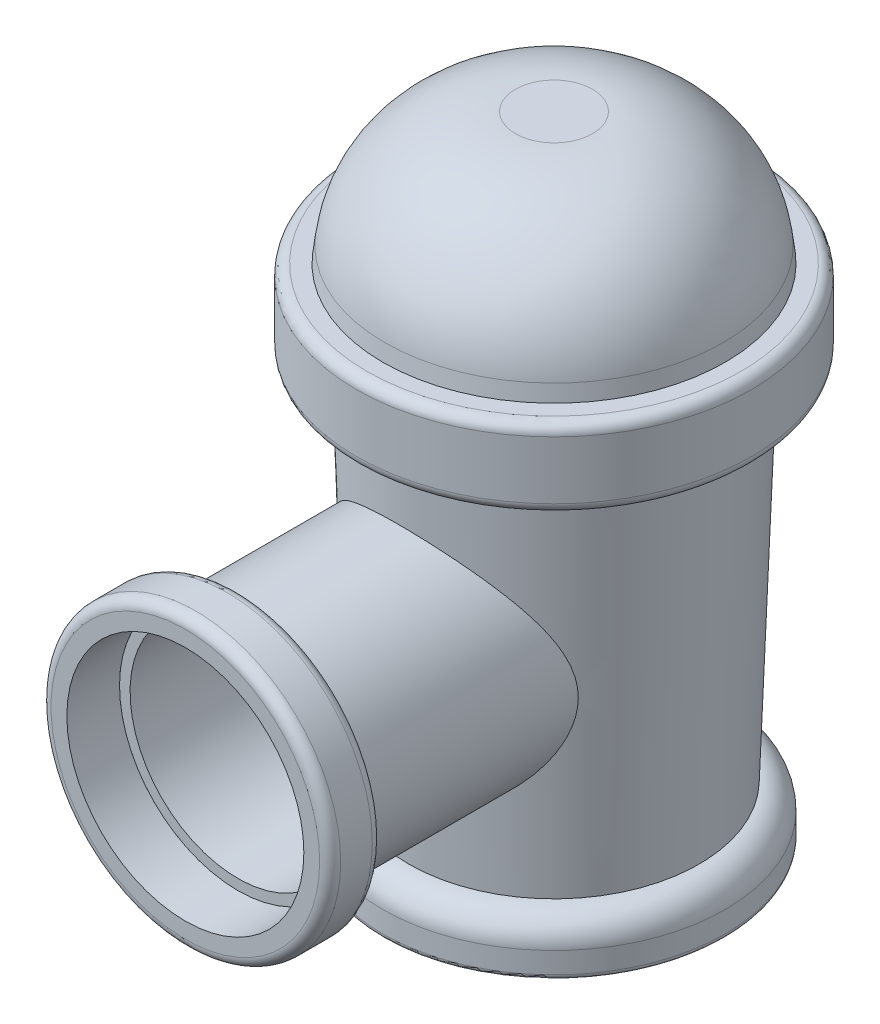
ISO-10303-21;
HEADER;
FILE_DESCRIPTION(('STEP AP214'),'2;1');
FILE_NAME('part.step','',(''),(''),'','','');
FILE_SCHEMA(('AUTOMOTIVE_DESIGN { 1 0 10303 214 1 1 1 1 }'));
ENDSEC;
DATA;
#1=APPLICATION_CONTEXT('core data for automotive mechanical design processes');
#2=APPLICATION_PROTOCOL_DEFINITION('international standard','automotive_design',2000,#1);
#3=PRODUCT_CONTEXT('',#1,'mechanical');
#4=PRODUCT('Part','Part','',(#3));
#5=PRODUCT_RELATED_PRODUCT_CATEGORY('part','',(#4));
#6=PRODUCT_DEFINITION_FORMATION('','',#4);
#7=PRODUCT_DEFINITION_CONTEXT('part definition',#1,'design');
#8=PRODUCT_DEFINITION('design','',#6,#7);
#9=PRODUCT_DEFINITION_SHAPE('','',#8);
#10=(LENGTH_UNIT() NAMED_UNIT(*) SI_UNIT(.MILLI.,.METRE.));
#11=(NAMED_UNIT(*) PLANE_ANGLE_UNIT() SI_UNIT($,.RADIAN.));
#12=(NAMED_UNIT(*) SI_UNIT($,.STERADIAN.) SOLID_ANGLE_UNIT());
#13=UNCERTAINTY_MEASURE_WITH_UNIT(LENGTH_MEASURE(1.E-05),#10,'distance_accuracy_value','');
#14=(GEOMETRIC_REPRESENTATION_CONTEXT(3) GLOBAL_UNCERTAINTY_ASSIGNED_CONTEXT((#13)) GLOBAL_UNIT_ASSIGNED_CONTEXT((#10,
#11,#12)) REPRESENTATION_CONTEXT('',''));
#15=CARTESIAN_POINT('',(0.,0.,0.));
#16=DIRECTION('',(0.,0.,1.));
#17=DIRECTION('',(1.,0.,0.));
#18=AXIS2_PLACEMENT_3D('',#15,#16,#17);
#19=CARTESIAN_POINT('',(0.,0.,0.));
#20=DIRECTION('',(0.,1.,0.));
#21=DIRECTION('',(0.,0.,1.));
#22=AXIS2_PLACEMENT_3D('',#19,#20,#21);
#23=CONICAL_SURFACE('',#22,30.,0.0349065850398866);
#24=CARTESIAN_POINT('',(0.,0.,0.));
#25=DIRECTION('',(0.,1.,0.));
#26=DIRECTION('',(0.,0.,1.));
#27=AXIS2_PLACEMENT_3D('',#24,#25,#26);
#28=CIRCLE('',#27,30.);
#29=CARTESIAN_POINT('',(0.,0.,30.));
#30=VERTEX_POINT('',#29);
#31=EDGE_CURVE('E89',#30,#30,#28,.T.);
#32=ORIENTED_EDGE('',*,*,#31,.F.);
#33=EDGE_LOOP('',(#32));
#34=FACE_BOUND('',#33,.T.);
#35=CARTESIAN_POINT('',(0.,-70.,0.));
#36=DIRECTION('',(0.,1.,0.));
#37=DIRECTION('',(0.,0.,1.));
#38=AXIS2_PLACEMENT_3D('',#35,#36,#37);
#39=CIRCLE('',#38,27.5555461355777);
#40=CARTESIAN_POINT('',(0.,-70.,27.5555461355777));
#41=VERTEX_POINT('',#40);
#42=EDGE_CURVE('E62',#41,#41,#39,.T.);
#43=ORIENTED_EDGE('',*,*,#42,.T.);
#44=EDGE_LOOP('',(#43));
#45=FACE_BOUND('',#44,.T.);
#46=CARTESIAN_POINT('',(-16.1333837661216,-51.3269781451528,23.1383640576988));
#47=CARTESIAN_POINT('',(-16.5688837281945,-50.8789815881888,22.8537768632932));
#48=CARTESIAN_POINT('',(-16.9848307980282,-50.4137858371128,22.5660084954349));
#49=CARTESIAN_POINT('',(-17.7770131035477,-49.4501586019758,21.9906582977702));
#50=CARTESIAN_POINT('',(-18.153224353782,-48.9517073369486,21.7030766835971));
#51=CARTESIAN_POINT('',(-18.8654813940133,-47.9212280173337,21.1351538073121));
#52=CARTESIAN_POINT('',(-19.2014490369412,-47.3891376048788,20.8548274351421));
#53=CARTESIAN_POINT('',(-19.8307126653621,-46.2923246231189,20.3109489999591));
#54=CARTESIAN_POINT('',(-20.1240289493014,-45.7276177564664,20.0473889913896));
#55=CARTESIAN_POINT('',(-20.5861859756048,-44.7357286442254,19.6210306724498));
#56=CARTESIAN_POINT('',(-20.7663131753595,-44.3167473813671,19.4513400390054));
#57=CARTESIAN_POINT('',(-21.1028009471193,-43.4624683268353,19.1302012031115));
#58=CARTESIAN_POINT('',(-21.2591624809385,-43.0271711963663,18.9787522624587));
#59=CARTESIAN_POINT('',(-21.5461653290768,-42.1420942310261,18.6994706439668));
#60=CARTESIAN_POINT('',(-21.6768732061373,-41.6923554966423,18.5715769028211));
#61=CARTESIAN_POINT('',(-21.911254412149,-40.7788257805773,18.3441979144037));
#62=CARTESIAN_POINT('',(-22.0149337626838,-40.3150379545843,18.2447063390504));
#63=CARTESIAN_POINT('',(-22.1786721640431,-39.4536831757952,18.0928068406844));
#64=CARTESIAN_POINT('',(-22.2431085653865,-39.0578411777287,18.0353347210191));
#65=CARTESIAN_POINT('',(-22.3509448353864,-38.2604285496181,17.9460334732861));
#66=CARTESIAN_POINT('',(-22.3943471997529,-37.858858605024,17.9142013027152));
#67=CARTESIAN_POINT('',(-22.4594645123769,-37.052926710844,17.877720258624));
#68=CARTESIAN_POINT('',(-22.4811906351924,-36.6485663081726,17.8730573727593));
#69=CARTESIAN_POINT('',(-22.5027809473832,-35.839873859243,17.891279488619));
#70=CARTESIAN_POINT('',(-22.502644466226,-35.4355418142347,17.9141653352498));
#71=CARTESIAN_POINT('',(-22.4807890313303,-34.6309930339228,17.9865888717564));
#72=CARTESIAN_POINT('',(-22.4591283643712,-34.2307681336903,18.0360544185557));
#73=CARTESIAN_POINT('',(-22.3949657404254,-33.4359069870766,18.159762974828));
#74=CARTESIAN_POINT('',(-22.3524637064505,-33.0412707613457,18.2340060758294));
#75=CARTESIAN_POINT('',(-22.247468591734,-32.2590549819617,18.4048457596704));
#76=CARTESIAN_POINT('',(-22.1849486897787,-31.8714856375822,18.5014722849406));
#77=CARTESIAN_POINT('',(-22.0409663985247,-31.1052541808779,18.7141340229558));
#78=CARTESIAN_POINT('',(-21.9594984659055,-30.7265947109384,18.8301749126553));
#79=CARTESIAN_POINT('',(-21.7294999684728,-29.7759409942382,19.1462224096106));
#80=CARTESIAN_POINT('',(-21.5685824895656,-29.210688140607,19.3575934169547));
#81=CARTESIAN_POINT('',(-21.2073884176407,-28.1048106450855,19.8092568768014));
#82=CARTESIAN_POINT('',(-21.0070903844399,-27.5641996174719,20.0495650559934));
#83=CARTESIAN_POINT('',(-20.5692772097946,-26.5068466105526,20.5507632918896));
#84=CARTESIAN_POINT('',(-20.3316913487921,-25.990152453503,20.8116919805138));
#85=CARTESIAN_POINT('',(-19.8213858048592,-24.9815623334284,21.3463690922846));
#86=CARTESIAN_POINT('',(-19.5486714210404,-24.4896626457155,21.6201155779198));
#87=CARTESIAN_POINT('',(-18.9555859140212,-23.5078459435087,22.1874028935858));
#88=CARTESIAN_POINT('',(-18.6335782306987,-23.0191067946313,22.4812695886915));
#89=CARTESIAN_POINT('',(-17.95298928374,-22.0686980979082,23.0704815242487));
#90=CARTESIAN_POINT('',(-17.5944057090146,-21.6070302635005,23.3658268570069));
#91=CARTESIAN_POINT('',(-16.8413861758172,-20.7119129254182,23.9524883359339));
#92=CARTESIAN_POINT('',(-16.4469776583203,-20.2784422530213,24.2438073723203));
#93=CARTESIAN_POINT('',(-15.6223774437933,-19.4407571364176,24.8177590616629));
#94=CARTESIAN_POINT('',(-15.1921876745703,-19.0365411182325,25.1003921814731));
#95=CARTESIAN_POINT('',(-14.3086167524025,-18.2700225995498,25.6447267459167));
#96=CARTESIAN_POINT('',(-13.8561921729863,-17.9068759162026,25.9067893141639));
#97=CARTESIAN_POINT('',(-12.9183379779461,-17.2126017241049,26.4139588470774));
#98=CARTESIAN_POINT('',(-12.4329072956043,-16.8814752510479,26.659065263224));
#99=CARTESIAN_POINT('',(-11.4304216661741,-16.2544466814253,27.1277793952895));
#100=CARTESIAN_POINT('',(-10.9133886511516,-15.9585205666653,27.3514017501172));
#101=CARTESIAN_POINT('',(-9.8491387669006,-15.4050655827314,27.7728954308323));
#102=CARTESIAN_POINT('',(-9.30192773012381,-15.1475293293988,27.9707717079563));
#103=CARTESIAN_POINT('',(-8.27403573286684,-14.7141647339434,28.3057551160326));
#104=CARTESIAN_POINT('',(-7.79757900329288,-14.5318764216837,28.4474886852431));
#105=CARTESIAN_POINT('',(-6.82766200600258,-14.1985576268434,28.7076882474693));
#106=CARTESIAN_POINT('',(-6.33420345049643,-14.0475240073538,28.8261565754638));
#107=CARTESIAN_POINT('',(-5.33319536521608,-13.7788051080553,29.0375627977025));
#108=CARTESIAN_POINT('',(-4.82565345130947,-13.6611021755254,29.1305142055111));
#109=CARTESIAN_POINT('',(-3.79946472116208,-13.4606992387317,29.2890943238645));
#110=CARTESIAN_POINT('',(-3.28081778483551,-13.3779996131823,29.3547227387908));
#111=CARTESIAN_POINT('',(-2.23408036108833,-13.2486952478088,29.4574487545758));
#112=CARTESIAN_POINT('',(-1.70596026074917,-13.202237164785,29.4944304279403));
#113=CARTESIAN_POINT('',(-0.64650324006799,-13.1467766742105,29.5385875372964));
#114=CARTESIAN_POINT('',(-0.115166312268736,-13.1377743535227,29.5457629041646));
#115=CARTESIAN_POINT('',(0.946368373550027,-13.1573848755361,29.5301426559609));
#116=CARTESIAN_POINT('',(1.47656612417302,-13.1859979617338,29.5073468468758));
#117=CARTESIAN_POINT('',(2.53151961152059,-13.2803366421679,29.4323042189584));
#118=CARTESIAN_POINT('',(3.05627551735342,-13.3460610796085,29.3800583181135));
#119=CARTESIAN_POINT('',(4.0635743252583,-13.5082257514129,29.2514651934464));
#120=CARTESIAN_POINT('',(4.54669493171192,-13.6024717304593,29.1768423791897));
#121=CARTESIAN_POINT('',(5.50170601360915,-13.8212479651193,29.0041498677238));
#122=CARTESIAN_POINT('',(5.97359706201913,-13.9457766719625,28.9060813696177));
#123=CARTESIAN_POINT('',(6.90373171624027,-14.2235605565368,28.6881776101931));
#124=CARTESIAN_POINT('',(7.36197346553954,-14.3768196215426,28.5683394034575));
#125=CARTESIAN_POINT('',(8.262729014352,-14.7103226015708,28.3088173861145));
#126=CARTESIAN_POINT('',(8.7052418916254,-14.8905680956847,28.1691324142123));
#127=CARTESIAN_POINT('',(9.61024377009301,-15.2928428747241,27.8591832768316));
#128=CARTESIAN_POINT('',(10.0711803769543,-15.5171319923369,27.6873227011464));
#129=CARTESIAN_POINT('',(10.9711085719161,-15.9931947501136,27.325303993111));
#130=CARTESIAN_POINT('',(11.4100991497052,-16.2449696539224,27.1351450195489));
#131=CARTESIAN_POINT('',(12.2652009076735,-16.7739851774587,26.739190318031));
#132=CARTESIAN_POINT('',(12.6813065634,-17.0512319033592,26.5333908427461));
#133=CARTESIAN_POINT('',(13.4898938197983,-17.6293071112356,26.1088586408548));
#134=CARTESIAN_POINT('',(13.8823722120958,-17.9301387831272,25.8901241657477));
#135=CARTESIAN_POINT('',(14.7191635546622,-18.6159875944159,25.3977140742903));
#136=CARTESIAN_POINT('',(15.1582022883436,-19.0058284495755,25.1217816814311));
#137=CARTESIAN_POINT('',(16.0012532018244,-19.8149269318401,24.5596841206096));
#138=CARTESIAN_POINT('',(16.4052603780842,-20.2341887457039,24.2735174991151));
#139=CARTESIAN_POINT('',(17.1784505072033,-21.101091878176,23.6952511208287));
#140=CARTESIAN_POINT('',(17.547585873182,-21.5487706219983,23.4031438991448));
#141=CARTESIAN_POINT('',(18.2500504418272,-22.4709788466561,22.8183641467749));
#142=CARTESIAN_POINT('',(18.5833818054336,-22.9455067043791,22.5256916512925));
#143=CARTESIAN_POINT('',(19.2129068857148,-23.9198425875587,21.945985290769));
#144=CARTESIAN_POINT('',(19.5091895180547,-24.4195858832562,21.6589393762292));
#145=CARTESIAN_POINT('',(20.0645743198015,-25.4455428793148,21.0960603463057));
#146=CARTESIAN_POINT('',(20.3236700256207,-25.9717611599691,20.8202291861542));
#147=CARTESIAN_POINT('',(20.8026014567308,-27.0501850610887,20.2877996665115));
#148=CARTESIAN_POINT('',(21.0224984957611,-27.6023483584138,20.0311716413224));
#149=CARTESIAN_POINT('',(21.3212234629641,-28.4503309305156,19.6674007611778));
#150=CARTESIAN_POINT('',(21.4155976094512,-28.7362285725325,19.5496914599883));
#151=CARTESIAN_POINT('',(21.5936275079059,-29.314692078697,19.322587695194));
#152=CARTESIAN_POINT('',(21.6772808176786,-29.6072594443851,19.2131951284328));
#153=CARTESIAN_POINT('',(21.8603346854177,-30.3009793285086,18.9680788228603));
#154=CARTESIAN_POINT('',(21.9552022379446,-30.7047509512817,18.8363017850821));
#155=CARTESIAN_POINT('',(22.1233710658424,-31.5229641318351,18.5941231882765));
#156=CARTESIAN_POINT('',(22.1966794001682,-31.937402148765,18.4837146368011));
#157=CARTESIAN_POINT('',(22.3203466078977,-32.774793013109,18.2880834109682));
#158=CARTESIAN_POINT('',(22.370748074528,-33.1977285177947,18.2028140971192));
#159=CARTESIAN_POINT('',(22.4476035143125,-34.0505256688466,18.0604850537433));
#160=CARTESIAN_POINT('',(22.4740579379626,-34.4803871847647,18.0034247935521));
#161=CARTESIAN_POINT('',(22.5022527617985,-35.347134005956,17.9196280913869));
#162=CARTESIAN_POINT('',(22.5038082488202,-35.7840477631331,17.8931198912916));
#163=CARTESIAN_POINT('',(22.4813785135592,-36.6579782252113,17.8722929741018));
#164=CARTESIAN_POINT('',(22.4573941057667,-37.0949949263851,17.8779732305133));
#165=CARTESIAN_POINT('',(22.3841363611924,-37.9657012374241,17.920999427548));
#166=CARTESIAN_POINT('',(22.3348403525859,-38.3993875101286,17.9583737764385));
#167=CARTESIAN_POINT('',(22.2118014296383,-39.2596488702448,18.0627531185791));
#168=CARTESIAN_POINT('',(22.1380550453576,-39.6862229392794,18.1297623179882));
#169=CARTESIAN_POINT('',(21.9517709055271,-40.6064454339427,18.3048864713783));
#170=CARTESIAN_POINT('',(21.8346134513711,-41.0981534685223,18.4182664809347));
#171=CARTESIAN_POINT('',(21.5700834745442,-42.0650299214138,18.6758237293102));
#172=CARTESIAN_POINT('',(21.4227038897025,-42.5401944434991,18.8200081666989));
#173=CARTESIAN_POINT('',(21.099484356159,-43.4735738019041,19.1331930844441));
#174=CARTESIAN_POINT('',(20.923578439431,-43.9317462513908,19.3022509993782));
#175=CARTESIAN_POINT('',(20.5453293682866,-44.8294211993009,19.6590665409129));
#176=CARTESIAN_POINT('',(20.3429843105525,-45.2689223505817,19.8468255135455));
#177=CARTESIAN_POINT('',(19.8222589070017,-46.3112854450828,20.318201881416));
#178=CARTESIAN_POINT('',(19.4910032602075,-46.9046010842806,20.6087693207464));
#179=CARTESIAN_POINT('',(18.7802792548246,-48.0537265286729,21.2048978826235));
#180=CARTESIAN_POINT('',(18.4007923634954,-48.6095217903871,21.510464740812));
#181=CARTESIAN_POINT('',(17.5947885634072,-49.683851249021,22.126703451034));
#182=CARTESIAN_POINT('',(17.1682274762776,-50.2023496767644,22.4373798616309));
#183=CARTESIAN_POINT('',(16.2693344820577,-51.2004016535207,23.0548295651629));
#184=CARTESIAN_POINT('',(15.7970091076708,-51.679960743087,23.3616034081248));
#185=CARTESIAN_POINT('',(14.7997122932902,-52.6051080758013,23.9680598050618));
#186=CARTESIAN_POINT('',(14.2740533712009,-53.0500737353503,24.2675652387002));
#187=CARTESIAN_POINT('',(13.1771189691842,-53.8945692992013,24.8468887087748));
#188=CARTESIAN_POINT('',(12.6058374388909,-54.2940931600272,25.1267041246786));
#189=CARTESIAN_POINT('',(11.4206473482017,-55.0424102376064,25.6584536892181));
#190=CARTESIAN_POINT('',(10.8068459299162,-55.3913245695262,25.9104540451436));
#191=CARTESIAN_POINT('',(9.85599544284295,-55.8733152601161,26.2623737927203));
#192=CARTESIAN_POINT('',(9.53406309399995,-56.0270652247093,26.3753209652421));
#193=CARTESIAN_POINT('',(8.88047348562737,-56.3201883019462,26.5917107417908));
#194=CARTESIAN_POINT('',(8.54881390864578,-56.4595579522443,26.6951510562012));
#195=CARTESIAN_POINT('',(7.73812631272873,-56.7773888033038,26.9320283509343));
#196=CARTESIAN_POINT('',(7.25460298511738,-56.9483447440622,27.0602992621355));
#197=CARTESIAN_POINT('',(6.27201380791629,-57.2580215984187,27.2936819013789));
#198=CARTESIAN_POINT('',(5.77295172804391,-57.3967502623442,27.3987991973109));
#199=CARTESIAN_POINT('',(4.76222905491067,-57.6401312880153,27.5838026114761));
#200=CARTESIAN_POINT('',(4.25057491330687,-57.7448007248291,27.6637013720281));
#201=CARTESIAN_POINT('',(3.21778350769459,-57.9186163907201,27.7966531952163));
#202=CARTESIAN_POINT('',(2.69664593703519,-57.9877614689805,27.8497053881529));
#203=CARTESIAN_POINT('',(1.64696355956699,-58.0895972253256,27.9279131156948));
#204=CARTESIAN_POINT('',(1.11839988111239,-58.1221658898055,27.9529752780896));
#205=CARTESIAN_POINT('',(0.0597084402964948,-58.149891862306,27.974307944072));
#206=CARTESIAN_POINT('',(-0.470419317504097,-58.1450492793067,27.9705785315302));
#207=CARTESIAN_POINT('',(-1.52802764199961,-58.0980353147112,27.9344154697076));
#208=CARTESIAN_POINT('',(-2.05550818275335,-58.0558635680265,27.9019815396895));
#209=CARTESIAN_POINT('',(-3.10373702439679,-57.9348865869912,27.809150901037));
#210=CARTESIAN_POINT('',(-3.62448544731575,-57.8560820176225,27.7487546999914));
#211=CARTESIAN_POINT('',(-4.63101091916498,-57.6676677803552,27.6048412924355));
#212=CARTESIAN_POINT('',(-5.11727439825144,-57.5596985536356,27.5225581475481));
#213=CARTESIAN_POINT('',(-6.07746819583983,-57.3130760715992,27.3354034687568));
#214=CARTESIAN_POINT('',(-6.55139892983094,-57.1744238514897,27.2305326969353));
#215=CARTESIAN_POINT('',(-7.484816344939,-56.8679953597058,27.0000000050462));
#216=CARTESIAN_POINT('',(-7.94429510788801,-56.7002034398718,26.8743269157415));
#217=CARTESIAN_POINT('',(-8.84664243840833,-56.3373014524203,26.6042972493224));
#218=CARTESIAN_POINT('',(-9.28951038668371,-56.1421903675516,26.4599399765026));
#219=CARTESIAN_POINT('',(-10.2003347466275,-55.705718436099,26.1395430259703));
#220=CARTESIAN_POINT('',(-10.6664046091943,-55.4616875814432,25.9617801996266));
#221=CARTESIAN_POINT('',(-11.575300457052,-54.9449272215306,25.5892938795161));
#222=CARTESIAN_POINT('',(-12.0181230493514,-54.6721935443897,25.3945679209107));
#223=CARTESIAN_POINT('',(-12.8790419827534,-54.1003677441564,24.9914280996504));
#224=CARTESIAN_POINT('',(-13.2971635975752,-53.8013033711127,24.7830287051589));
#225=CARTESIAN_POINT('',(-14.1084505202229,-53.1783670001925,24.3554604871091));
#226=CARTESIAN_POINT('',(-14.5016232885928,-52.8545024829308,24.136294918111));
#227=CARTESIAN_POINT('',(-15.098915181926,-52.3277544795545,23.7862455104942));
#228=CARTESIAN_POINT('',(-15.3115921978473,-52.1327713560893,23.6579494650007));
#229=CARTESIAN_POINT('',(-15.7286857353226,-51.7353972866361,23.3994478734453));
#230=CARTESIAN_POINT('',(-15.9331024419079,-51.5330065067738,23.2692423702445));
#231=CARTESIAN_POINT('',(-16.1333837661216,-51.3269781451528,23.1383640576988));
#232=B_SPLINE_CURVE_WITH_KNOTS('',3,(#46,#47,#48,#49,#50,#51,#52,#53,#54,#55,#56,#57,#58,#59,
#60,#61,#62,#63,#64,#65,#66,#67,#68,#69,#70,#71,#72,#73,#74,#75,#76,#77,#78,#79,#80,#81,#82,#83,
#84,#85,#86,#87,#88,#89,#90,#91,#92,#93,#94,#95,#96,#97,#98,#99,#100,#101,#102,#103,#104,#105,
#106,#107,#108,#109,#110,#111,#112,#113,#114,#115,#116,#117,#118,#119,#120,#121,#122,#123,#124,
#125,#126,#127,#128,#129,#130,#131,#132,#133,#134,#135,#136,#137,#138,#139,#140,#141,#142,#143,
#144,#145,#146,#147,#148,#149,#150,#151,#152,#153,#154,#155,#156,#157,#158,#159,#160,#161,#162,
#163,#164,#165,#166,#167,#168,#169,#170,#171,#172,#173,#174,#175,#176,#177,#178,#179,#180,#181,
#182,#183,#184,#185,#186,#187,#188,#189,#190,#191,#192,#193,#194,#195,#196,#197,#198,#199,#200,
#201,#202,#203,#204,#205,#206,#207,#208,#209,#210,#211,#212,#213,#214,#215,#216,#217,#218,#219,
#220,#221,#222,#223,#224,#225,#226,#227,#228,#229,#230,#231),.UNSPECIFIED.,.T.,.F.,(4,2,2,2,2,2,
2,2,2,2,2,2,2,2,2,2,2,2,2,2,2,2,2,2,2,2,2,2,2,2,2,2,2,2,2,2,2,2,2,2,2,2,2,2,2,2,2,2,2,2,2,2,2,2,
2,2,2,2,2,2,2,2,2,2,2,2,2,2,2,2,2,2,2,2,2,2,2,2,2,2,2,2,2,2,2,2,2,2,2,2,2,2,4),(0.,
2.05941680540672,4.12006970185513,6.18466134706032,8.24826718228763,9.70706393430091,
11.1658016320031,12.6207028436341,14.0752796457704,15.2894368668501,16.5034499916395,
17.7168369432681,18.9302611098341,20.1404082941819,21.3505599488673,22.5623398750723,
23.7744747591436,25.6452148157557,27.516976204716,29.3923314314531,31.2674040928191,
33.2305302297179,35.1937804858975,37.1555394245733,39.1171927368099,41.0251739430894,
42.9332168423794,44.8399502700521,46.7463164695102,48.3331162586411,49.9197567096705,
51.5055552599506,53.0913709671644,54.6835710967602,56.2757749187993,57.8679890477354,
59.4601535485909,60.9520811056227,62.4439323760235,63.9359856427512,65.4281262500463,
67.0485248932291,68.6689980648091,70.2898607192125,71.9109429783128,73.8553456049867,
75.8000254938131,77.7473219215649,79.6945007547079,81.6369128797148,83.5796622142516,
85.5193455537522,86.4888410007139,87.4585569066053,88.7630319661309,90.0670794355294,
91.3686921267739,92.670280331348,93.981530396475,95.2927386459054,96.6051234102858,
97.9176945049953,99.4694224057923,101.021513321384,102.577246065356,104.133090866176,
106.347120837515,108.562004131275,110.7789840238,112.995647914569,115.245796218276,
117.496243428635,119.741212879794,120.863414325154,121.985885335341,123.57012927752,
125.153991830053,126.737059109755,128.320177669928,129.908561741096,131.496941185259,
133.085336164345,134.673702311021,136.18664611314,137.699538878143,139.213246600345,
140.727010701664,142.391354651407,144.055940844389,145.718793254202,147.381146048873,
148.328268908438,149.275370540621),.UNSPECIFIED.);
#233=CARTESIAN_POINT('',(-16.1333837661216,-51.3269781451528,23.1383640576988));
#234=VERTEX_POINT('',#233);
#235=EDGE_CURVE('E67',#234,#234,#232,.T.);
#236=ORIENTED_EDGE('',*,*,#235,.T.);
#237=EDGE_LOOP('',(#236));
#238=FACE_BOUND('',#237,.T.);
#239=ADVANCED_FACE('F39',(#34,#45,#238),#23,.T.);
#240=CARTESIAN_POINT('',(0.,15.,0.));
#241=DIRECTION('',(0.,-1.,0.));
#242=DIRECTION('',(0.,0.,-1.));
#243=AXIS2_PLACEMENT_3D('',#240,#241,#242);
#244=CYLINDRICAL_SURFACE('',#243,37.5);
#245=CARTESIAN_POINT('',(0.,13.,0.));
#246=DIRECTION('',(0.,1.,0.));
#247=DIRECTION('',(0.,0.,1.));
#248=AXIS2_PLACEMENT_3D('',#245,#246,#247);
#249=CIRCLE('',#248,37.5);
#250=CARTESIAN_POINT('',(0.,13.,37.5));
#251=VERTEX_POINT('',#250);
#252=EDGE_CURVE('E91',#251,#251,#249,.F.);
#253=ORIENTED_EDGE('',*,*,#252,.T.);
#254=EDGE_LOOP('',(#253));
#255=FACE_BOUND('',#254,.T.);
#256=CARTESIAN_POINT('',(0.,2.,0.));
#257=DIRECTION('',(0.,1.,0.));
#258=DIRECTION('',(0.,0.,1.));
#259=AXIS2_PLACEMENT_3D('',#256,#257,#258);
#260=CIRCLE('',#259,37.5);
#261=CARTESIAN_POINT('',(0.,2.,37.5));
#262=VERTEX_POINT('',#261);
#263=EDGE_CURVE('E94',#262,#262,#260,.T.);
#264=ORIENTED_EDGE('',*,*,#263,.T.);
#265=EDGE_LOOP('',(#264));
#266=FACE_BOUND('',#265,.T.);
#267=ADVANCED_FACE('F142',(#255,#266),#244,.T.);
#268=CARTESIAN_POINT('',(0.,15.,0.));
#269=DIRECTION('',(0.,1.,0.));
#270=DIRECTION('',(0.,0.,1.));
#271=AXIS2_PLACEMENT_3D('',#268,#269,#270);
#272=PLANE('',#271);
#273=CARTESIAN_POINT('',(0.,15.,0.));
#274=DIRECTION('',(0.,1.,0.));
#275=DIRECTION('',(0.,0.,1.));
#276=AXIS2_PLACEMENT_3D('',#273,#274,#275);
#277=CIRCLE('',#276,35.5);
#278=CARTESIAN_POINT('',(0.,15.,35.5));
#279=VERTEX_POINT('',#278);
#280=EDGE_CURVE('E90',#279,#279,#277,.T.);
#281=ORIENTED_EDGE('',*,*,#280,.T.);
#282=EDGE_LOOP('',(#281));
#283=FACE_BOUND('',#282,.T.);
#284=CARTESIAN_POINT('',(0.,15.,0.));
#285=DIRECTION('',(0.,1.,0.));
#286=DIRECTION('',(0.,0.,1.));
#287=AXIS2_PLACEMENT_3D('',#284,#285,#286);
#288=CIRCLE('',#287,32.5);
#289=CARTESIAN_POINT('',(0.,15.,32.5));
#290=VERTEX_POINT('',#289);
#291=EDGE_CURVE('E58',#290,#290,#288,.T.);
#292=ORIENTED_EDGE('',*,*,#291,.F.);
#293=EDGE_LOOP('',(#292));
#294=FACE_BOUND('',#293,.T.);
#295=ADVANCED_FACE('F147',(#283,#294),#272,.T.);
#296=CARTESIAN_POINT('',(0.,0.,0.));
#297=DIRECTION('',(0.,1.,0.));
#298=DIRECTION('',(0.,0.,1.));
#299=AXIS2_PLACEMENT_3D('',#296,#297,#298);
#300=PLANE('',#299);
#301=CARTESIAN_POINT('',(0.,0.,0.));
#302=DIRECTION('',(0.,1.,0.));
#303=DIRECTION('',(0.,0.,1.));
#304=AXIS2_PLACEMENT_3D('',#301,#302,#303);
#305=CIRCLE('',#304,35.5);
#306=CARTESIAN_POINT('',(0.,0.,35.5));
#307=VERTEX_POINT('',#306);
#308=EDGE_CURVE('E86',#307,#307,#305,.F.);
#309=ORIENTED_EDGE('',*,*,#308,.T.);
#310=EDGE_LOOP('',(#309));
#311=FACE_BOUND('',#310,.T.);
#312=ORIENTED_EDGE('',*,*,#31,.T.);
#313=EDGE_LOOP('',(#312));
#314=FACE_BOUND('',#313,.T.);
#315=ADVANCED_FACE('F188',(#311,#314),#300,.F.);
#316=CARTESIAN_POINT('',(0.,15.,0.));
#317=DIRECTION('',(0.,-1.,0.));
#318=DIRECTION('',(0.,0.,1.));
#319=AXIS2_PLACEMENT_3D('',#316,#317,#318);
#320=CONICAL_SURFACE('',#319,32.5,0.122173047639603);
#321=CARTESIAN_POINT('',(0.,18.0467335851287,0.));
#322=DIRECTION('',(0.,-1.,0.));
#323=DIRECTION('',(0.,0.,-1.));
#324=AXIS2_PLACEMENT_3D('',#321,#322,#323);
#325=CIRCLE('',#324,32.1259081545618);
#326=CARTESIAN_POINT('',(0.,18.0467335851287,-32.1259081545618));
#327=VERTEX_POINT('',#326);
#328=EDGE_CURVE('E105',#327,#327,#325,.T.);
#329=ORIENTED_EDGE('',*,*,#328,.T.);
#330=EDGE_LOOP('',(#329));
#331=FACE_BOUND('',#330,.T.);
#332=ORIENTED_EDGE('',*,*,#291,.T.);
#333=EDGE_LOOP('',(#332));
#334=FACE_BOUND('',#333,.T.);
#335=ADVANCED_FACE('F176',(#331,#334),#320,.T.);
#336=CARTESIAN_POINT('',(0.,40.,0.));
#337=DIRECTION('',(0.,1.,0.));
#338=DIRECTION('',(0.,0.,1.));
#339=AXIS2_PLACEMENT_3D('',#336,#337,#338);
#340=PLANE('',#339);
#341=CARTESIAN_POINT('',(0.,40.,0.));
#342=DIRECTION('',(0.,1.,0.));
#343=DIRECTION('',(0.,0.,1.));
#344=AXIS2_PLACEMENT_3D('',#341,#342,#343);
#345=CIRCLE('',#344,7.31225436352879);
#346=CARTESIAN_POINT('',(0.,40.,7.31225436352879));
#347=VERTEX_POINT('',#346);
#348=EDGE_CURVE('E82',#347,#347,#345,.T.);
#349=ORIENTED_EDGE('',*,*,#348,.T.);
#350=EDGE_LOOP('',(#349));
#351=FACE_BOUND('',#350,.T.);
#352=ADVANCED_FACE('F118',(#351),#340,.T.);
#353=CARTESIAN_POINT('',(0.,15.,0.));
#354=DIRECTION('',(0.,1.,0.));
#355=DIRECTION('',(0.,0.,1.));
#356=AXIS2_PLACEMENT_3D('',#353,#354,#355);
#357=DEGENERATE_TOROIDAL_SURFACE('',#356,7.31225436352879,25.,.T.);
#358=ORIENTED_EDGE('',*,*,#328,.F.);
#359=EDGE_LOOP('',(#358));
#360=FACE_BOUND('',#359,.T.);
#361=ORIENTED_EDGE('',*,*,#348,.F.);
#362=EDGE_LOOP('',(#361));
#363=FACE_BOUND('',#362,.T.);
#364=ADVANCED_FACE('F116',(#360,#363),#357,.T.);
#365=CARTESIAN_POINT('',(0.,-35.6437409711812,60.));
#366=DIRECTION('',(0.,0.,-1.));
#367=DIRECTION('',(-1.,0.,0.));
#368=AXIS2_PLACEMENT_3D('',#365,#366,#367);
#369=CYLINDRICAL_SURFACE('',#368,22.5);
#370=ORIENTED_EDGE('',*,*,#235,.F.);
#371=EDGE_LOOP('',(#370));
#372=FACE_BOUND('',#371,.T.);
#373=CARTESIAN_POINT('',(0.,-35.6437409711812,60.));
#374=DIRECTION('',(0.,0.,1.));
#375=DIRECTION('',(1.,0.,0.));
#376=AXIS2_PLACEMENT_3D('',#373,#374,#375);
#377=CIRCLE('',#376,22.5);
#378=CARTESIAN_POINT('',(22.5,-35.6437409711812,60.));
#379=VERTEX_POINT('',#378);
#380=EDGE_CURVE('E11',#379,#379,#377,.T.);
#381=ORIENTED_EDGE('',*,*,#380,.F.);
#382=EDGE_LOOP('',(#381));
#383=FACE_BOUND('',#382,.T.);
#384=ADVANCED_FACE('F110',(#372,#383),#369,.T.);
#385=CARTESIAN_POINT('',(0.,13.,0.));
#386=DIRECTION('',(0.,1.,0.));
#387=DIRECTION('',(0.,0.,1.));
#388=AXIS2_PLACEMENT_3D('',#385,#386,#387);
#389=TOROIDAL_SURFACE('',#388,35.5,2.);
#390=ORIENTED_EDGE('',*,*,#252,.F.);
#391=EDGE_LOOP('',(#390));
#392=FACE_BOUND('',#391,.T.);
#393=ORIENTED_EDGE('',*,*,#280,.F.);
#394=EDGE_LOOP('',(#393));
#395=FACE_BOUND('',#394,.T.);
#396=ADVANCED_FACE('F115',(#392,#395),#389,.T.);
#397=CARTESIAN_POINT('',(0.,2.,0.));
#398=DIRECTION('',(0.,1.,0.));
#399=DIRECTION('',(0.,0.,1.));
#400=AXIS2_PLACEMENT_3D('',#397,#398,#399);
#401=TOROIDAL_SURFACE('',#400,35.5,2.);
#402=ORIENTED_EDGE('',*,*,#308,.F.);
#403=EDGE_LOOP('',(#402));
#404=FACE_BOUND('',#403,.T.);
#405=ORIENTED_EDGE('',*,*,#263,.F.);
#406=EDGE_LOOP('',(#405));
#407=FACE_BOUND('',#406,.T.);
#408=ADVANCED_FACE('F124',(#404,#407),#401,.T.);
#409=CARTESIAN_POINT('',(0.,-80.,0.));
#410=DIRECTION('',(0.,1.,0.));
#411=DIRECTION('',(0.,0.,1.));
#412=AXIS2_PLACEMENT_3D('',#409,#410,#411);
#413=CYLINDRICAL_SURFACE('',#412,32.5);
#414=CARTESIAN_POINT('',(0.,-79.,0.));
#415=DIRECTION('',(0.,-1.,0.));
#416=DIRECTION('',(0.,0.,-1.));
#417=AXIS2_PLACEMENT_3D('',#414,#415,#416);
#418=CIRCLE('',#417,32.5);
#419=CARTESIAN_POINT('',(0.,-79.,-32.5));
#420=VERTEX_POINT('',#419);
#421=EDGE_CURVE('E80',#420,#420,#418,.F.);
#422=ORIENTED_EDGE('',*,*,#421,.T.);
#423=EDGE_LOOP('',(#422));
#424=FACE_BOUND('',#423,.T.);
#425=CARTESIAN_POINT('',(0.,-74.9996914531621,0.));
#426=DIRECTION('',(0.,1.,0.));
#427=DIRECTION('',(0.,0.,1.));
#428=AXIS2_PLACEMENT_3D('',#425,#426,#427);
#429=CIRCLE('',#428,32.5);
#430=CARTESIAN_POINT('',(0.,-74.9996914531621,32.5));
#431=VERTEX_POINT('',#430);
#432=EDGE_CURVE('E55',#431,#431,#429,.F.);
#433=ORIENTED_EDGE('',*,*,#432,.T.);
#434=EDGE_LOOP('',(#433));
#435=FACE_BOUND('',#434,.T.);
#436=ADVANCED_FACE('F120',(#424,#435),#413,.T.);
#437=CARTESIAN_POINT('',(0.,-80.,0.));
#438=DIRECTION('',(0.,-1.,0.));
#439=DIRECTION('',(0.,0.,-1.));
#440=AXIS2_PLACEMENT_3D('',#437,#438,#439);
#441=PLANE('',#440);
#442=CARTESIAN_POINT('',(0.,-80.,0.));
#443=DIRECTION('',(0.,-1.,0.));
#444=DIRECTION('',(0.,0.,-1.));
#445=AXIS2_PLACEMENT_3D('',#442,#443,#444);
#446=CIRCLE('',#445,22.5);
#447=CARTESIAN_POINT('',(0.,-80.,-22.5));
#448=VERTEX_POINT('',#447);
#449=EDGE_CURVE('E46',#448,#448,#446,.T.);
#450=ORIENTED_EDGE('',*,*,#449,.F.);
#451=EDGE_LOOP('',(#450));
#452=FACE_BOUND('',#451,.T.);
#453=CARTESIAN_POINT('',(0.,-80.,0.));
#454=DIRECTION('',(0.,-1.,0.));
#455=DIRECTION('',(0.,0.,-1.));
#456=AXIS2_PLACEMENT_3D('',#453,#454,#455);
#457=CIRCLE('',#456,31.5);
#458=CARTESIAN_POINT('',(0.,-80.,-31.5));
#459=VERTEX_POINT('',#458);
#460=EDGE_CURVE('E50',#459,#459,#457,.T.);
#461=ORIENTED_EDGE('',*,*,#460,.T.);
#462=EDGE_LOOP('',(#461));
#463=FACE_BOUND('',#462,.T.);
#464=ADVANCED_FACE('F123',(#452,#463),#441,.T.);
#465=CARTESIAN_POINT('',(0.,-74.9996914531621,0.));
#466=DIRECTION('',(0.,1.,0.));
#467=DIRECTION('',(0.,0.,1.));
#468=AXIS2_PLACEMENT_3D('',#465,#466,#467);
#469=TOROIDAL_SURFACE('',#468,27.5,5.);
#470=ORIENTED_EDGE('',*,*,#42,.F.);
#471=EDGE_LOOP('',(#470));
#472=FACE_BOUND('',#471,.T.);
#473=ORIENTED_EDGE('',*,*,#432,.F.);
#474=EDGE_LOOP('',(#473));
#475=FACE_BOUND('',#474,.T.);
#476=ADVANCED_FACE('F127',(#472,#475),#469,.T.);
#477=CARTESIAN_POINT('',(0.,-79.,0.));
#478=DIRECTION('',(0.,-1.,0.));
#479=DIRECTION('',(0.,0.,-1.));
#480=AXIS2_PLACEMENT_3D('',#477,#478,#479);
#481=TOROIDAL_SURFACE('',#480,31.5,1.);
#482=ORIENTED_EDGE('',*,*,#421,.F.);
#483=EDGE_LOOP('',(#482));
#484=FACE_BOUND('',#483,.T.);
#485=ORIENTED_EDGE('',*,*,#460,.F.);
#486=EDGE_LOOP('',(#485));
#487=FACE_BOUND('',#486,.T.);
#488=ADVANCED_FACE('F131',(#484,#487),#481,.T.);
#489=CARTESIAN_POINT('',(0.,-70.,0.));
#490=DIRECTION('',(0.,-1.,0.));
#491=DIRECTION('',(0.,0.,-1.));
#492=AXIS2_PLACEMENT_3D('',#489,#490,#491);
#493=CYLINDRICAL_SURFACE('',#492,22.5);
#494=CARTESIAN_POINT('',(0.,-70.,0.));
#495=DIRECTION('',(0.,-1.,0.));
#496=DIRECTION('',(0.,0.,-1.));
#497=AXIS2_PLACEMENT_3D('',#494,#495,#496);
#498=CIRCLE('',#497,22.5);
#499=CARTESIAN_POINT('',(0.,-70.,-22.5));
#500=VERTEX_POINT('',#499);
#501=EDGE_CURVE('E60',#500,#500,#498,.T.);
#502=ORIENTED_EDGE('',*,*,#501,.F.);
#503=EDGE_LOOP('',(#502));
#504=FACE_BOUND('',#503,.T.);
#505=ORIENTED_EDGE('',*,*,#449,.T.);
#506=EDGE_LOOP('',(#505));
#507=FACE_BOUND('',#506,.T.);
#508=ADVANCED_FACE('F129',(#504,#507),#493,.F.);
#509=CARTESIAN_POINT('',(0.,-35.6437409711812,60.));
#510=DIRECTION('',(0.,0.,1.));
#511=DIRECTION('',(1.,0.,0.));
#512=AXIS2_PLACEMENT_3D('',#509,#510,#511);
#513=PLANE('',#512);
#514=CARTESIAN_POINT('',(0.,-35.6437409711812,60.));
#515=DIRECTION('',(0.,0.,1.));
#516=DIRECTION('',(1.,0.,0.));
#517=AXIS2_PLACEMENT_3D('',#514,#515,#516);
#518=CIRCLE('',#517,20.5);
#519=CARTESIAN_POINT('',(20.5,-35.6437409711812,60.));
#520=VERTEX_POINT('',#519);
#521=EDGE_CURVE('E63',#520,#520,#518,.T.);
#522=ORIENTED_EDGE('',*,*,#521,.F.);
#523=EDGE_LOOP('',(#522));
#524=FACE_BOUND('',#523,.T.);
#525=ORIENTED_EDGE('',*,*,#380,.T.);
#526=EDGE_LOOP('',(#525));
#527=FACE_BOUND('',#526,.T.);
#528=ADVANCED_FACE('F41',(#524,#527),#513,.T.);
#529=CARTESIAN_POINT('',(0.,0.069798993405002,0.));
#530=DIRECTION('',(0.,1.,0.));
#531=DIRECTION('',(0.,0.,1.));
#532=AXIS2_PLACEMENT_3D('',#529,#530,#531);
#533=CONICAL_SURFACE('',#532,28.0012183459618,0.0349065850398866);
#534=CARTESIAN_POINT('',(0.,2.,0.));
#535=DIRECTION('',(0.,1.,0.));
#536=DIRECTION('',(0.,0.,1.));
#537=AXIS2_PLACEMENT_3D('',#534,#535,#536);
#538=CIRCLE('',#537,28.0686224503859);
#539=CARTESIAN_POINT('',(0.,2.,28.0686224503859));
#540=VERTEX_POINT('',#539);
#541=EDGE_CURVE('E418',#540,#540,#538,.T.);
#542=ORIENTED_EDGE('',*,*,#541,.T.);
#543=EDGE_LOOP('',(#542));
#544=FACE_BOUND('',#543,.T.);
#545=CARTESIAN_POINT('',(0.,-72.8033703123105,0.));
#546=DIRECTION('',(0.,-1.,0.));
#547=DIRECTION('',(0.,0.,-1.));
#548=AXIS2_PLACEMENT_3D('',#545,#546,#547);
#549=CIRCLE('',#548,25.4564311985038);
#550=CARTESIAN_POINT('',(0.,-72.8033703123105,-25.4564311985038));
#551=VERTEX_POINT('',#550);
#552=EDGE_CURVE('E411',#551,#551,#549,.F.);
#553=ORIENTED_EDGE('',*,*,#552,.F.);
#554=EDGE_LOOP('',(#553));
#555=FACE_BOUND('',#554,.T.);
#556=CARTESIAN_POINT('',(12.5611832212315,-19.442917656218,24.2608573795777));
#557=CARTESIAN_POINT('',(13.0639807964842,-19.832757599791,23.9851978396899));
#558=CARTESIAN_POINT('',(13.5452971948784,-20.2434084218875,23.6995115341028));
#559=CARTESIAN_POINT('',(14.4640317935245,-21.1028395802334,23.1148639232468));
#560=CARTESIAN_POINT('',(14.9014298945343,-21.5516372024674,22.8158966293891));
#561=CARTESIAN_POINT('',(15.7324306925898,-22.4857697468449,22.2110958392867));
#562=CARTESIAN_POINT('',(16.1259440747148,-22.9711759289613,21.9052498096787));
#563=CARTESIAN_POINT('',(16.8673666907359,-23.9761859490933,21.294832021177));
#564=CARTESIAN_POINT('',(17.2152888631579,-24.4957800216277,20.9902599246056));
#565=CARTESIAN_POINT('',(17.8038283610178,-25.4685888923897,20.4468123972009));
#566=CARTESIAN_POINT('',(18.0523557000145,-25.916106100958,20.206279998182));
#567=CARTESIAN_POINT('',(18.5174175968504,-26.8335312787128,19.7370584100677));
#568=CARTESIAN_POINT('',(18.7339504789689,-27.3034404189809,19.5083698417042));
#569=CARTESIAN_POINT('',(19.1329206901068,-28.2646245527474,19.0697095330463));
#570=CARTESIAN_POINT('',(19.3154369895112,-28.7558467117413,18.8596950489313));
#571=CARTESIAN_POINT('',(19.5622865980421,-29.5088675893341,18.5640261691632));
#572=CARTESIAN_POINT('',(19.640073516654,-29.7625366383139,18.4687070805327));
#573=CARTESIAN_POINT('',(19.7863747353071,-30.2752707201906,18.285510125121));
#574=CARTESIAN_POINT('',(19.8548867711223,-30.5343370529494,18.1976340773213));
#575=CARTESIAN_POINT('',(20.0090225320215,-31.1676590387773,17.9952724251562));
#576=CARTESIAN_POINT('',(20.0897246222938,-31.5445365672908,17.8851390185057));
#577=CARTESIAN_POINT('',(20.2304044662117,-32.3074097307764,17.6854077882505));
#578=CARTESIAN_POINT('',(20.2903885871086,-32.6934025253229,17.5958036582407));
#579=CARTESIAN_POINT('',(20.3884461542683,-33.4723214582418,17.4402746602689));
#580=CARTESIAN_POINT('',(20.4265526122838,-33.8652362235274,17.3743141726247));
#581=CARTESIAN_POINT('',(20.4800314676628,-34.6561331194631,17.2684316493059));
#582=CARTESIAN_POINT('',(20.4954041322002,-35.0541151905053,17.2285093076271));
#583=CARTESIAN_POINT('',(20.5028426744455,-35.8542061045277,17.1761823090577));
#584=CARTESIAN_POINT('',(20.4947870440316,-36.2563256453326,17.1639217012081));
#585=CARTESIAN_POINT('',(20.4550220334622,-37.0592432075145,17.1677097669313));
#586=CARTESIAN_POINT('',(20.4233130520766,-37.4600412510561,17.1837579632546));
#587=CARTESIAN_POINT('',(20.3366529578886,-38.2574712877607,17.2432022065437));
#588=CARTESIAN_POINT('',(20.2816771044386,-38.6540983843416,17.2866273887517));
#589=CARTESIAN_POINT('',(20.1493789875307,-39.4399761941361,17.3986901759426));
#590=CARTESIAN_POINT('',(20.0720535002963,-39.8292258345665,17.4673314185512));
#591=CARTESIAN_POINT('',(19.8759326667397,-40.6868336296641,17.6452997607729));
#592=CARTESIAN_POINT('',(19.7516874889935,-41.1527565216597,17.7603570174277));
#593=CARTESIAN_POINT('',(19.4733582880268,-42.0676958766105,18.0180825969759));
#594=CARTESIAN_POINT('',(19.3192661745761,-42.5167077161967,18.1607584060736));
#595=CARTESIAN_POINT('',(18.9829385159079,-43.39750034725,18.4679531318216));
#596=CARTESIAN_POINT('',(18.8006412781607,-43.8292406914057,18.6325198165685));
#597=CARTESIAN_POINT('',(18.4098331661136,-44.6739489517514,18.9776816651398));
#598=CARTESIAN_POINT('',(18.2013208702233,-45.08691584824,19.1582776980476));
#599=CARTESIAN_POINT('',(17.6793554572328,-46.0400426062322,19.5979839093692));
#600=CARTESIAN_POINT('',(17.3552250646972,-46.5721779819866,19.861864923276));
#601=CARTESIAN_POINT('',(16.6627760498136,-47.6014482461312,20.3998864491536));
#602=CARTESIAN_POINT('',(16.2944432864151,-48.098571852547,20.6740302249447));
#603=CARTESIAN_POINT('',(15.5146347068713,-49.0574731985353,21.2240285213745));
#604=CARTESIAN_POINT('',(15.1031271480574,-49.5192244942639,21.4998841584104));
#605=CARTESIAN_POINT('',(14.2381318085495,-50.4054801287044,22.0454093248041));
#606=CARTESIAN_POINT('',(13.7846492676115,-50.8299891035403,22.3150796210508));
#607=CARTESIAN_POINT('',(12.8327723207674,-51.6426317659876,22.8432974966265));
#608=CARTESIAN_POINT('',(12.3340547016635,-52.0304553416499,23.1017417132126));
#609=CARTESIAN_POINT('',(11.2959960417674,-52.762559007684,23.5983478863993));
#610=CARTESIAN_POINT('',(10.7566500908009,-53.1068338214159,23.8365073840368));
#611=CARTESIAN_POINT('',(9.64067975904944,-53.7467687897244,24.285208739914));
#612=CARTESIAN_POINT('',(9.06415122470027,-54.0425474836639,24.495817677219));
#613=CARTESIAN_POINT('',(8.17358983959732,-54.4466334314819,24.7864400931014));
#614=CARTESIAN_POINT('',(7.87248049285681,-54.5747182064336,24.87908907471));
#615=CARTESIAN_POINT('',(7.2620603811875,-54.8171686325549,25.0552531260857));
#616=CARTESIAN_POINT('',(6.9527476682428,-54.9315309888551,25.1387660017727));
#617=CARTESIAN_POINT('',(6.20001253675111,-55.1892197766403,25.3276514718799));
#618=CARTESIAN_POINT('',(5.75294854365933,-55.3255523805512,25.4282035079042));
#619=CARTESIAN_POINT('',(4.8466052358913,-55.5681091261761,25.6077873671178));
#620=CARTESIAN_POINT('',(4.3873288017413,-55.6743403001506,25.6868242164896));
#621=CARTESIAN_POINT('',(3.45947319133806,-55.8552551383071,25.8217768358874));
#622=CARTESIAN_POINT('',(2.99089887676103,-55.9299548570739,25.8777043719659));
#623=CARTESIAN_POINT('',(2.04742608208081,-56.0467797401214,25.965296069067));
#624=CARTESIAN_POINT('',(1.57252736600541,-56.0889036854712,25.9969593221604));
#625=CARTESIAN_POINT('',(0.618900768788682,-56.1399710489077,26.03535645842));
#626=CARTESIAN_POINT('',(0.140166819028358,-56.1488423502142,26.0420361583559));
#627=CARTESIAN_POINT('',(-0.816429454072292,-56.1330620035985,26.0301640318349));
#628=CARTESIAN_POINT('',(-1.29429178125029,-56.1084105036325,26.0116123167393));
#629=CARTESIAN_POINT('',(-2.24561229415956,-56.0259694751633,25.9496908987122));
#630=CARTESIAN_POINT('',(-2.71906954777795,-55.9681730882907,25.9063160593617));
#631=CARTESIAN_POINT('',(-3.65806854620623,-55.8203225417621,25.7956989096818));
#632=CARTESIAN_POINT('',(-4.12361029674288,-55.7302684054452,25.7284566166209));
#633=CARTESIAN_POINT('',(-5.03143956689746,-55.5220132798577,25.5736166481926));
#634=CARTESIAN_POINT('',(-5.47401612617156,-55.404627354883,25.4866099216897));
#635=CARTESIAN_POINT('',(-6.34636921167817,-55.1419744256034,25.2929628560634));
#636=CARTESIAN_POINT('',(-6.77614605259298,-54.9967081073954,25.1863230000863));
#637=CARTESIAN_POINT('',(-7.62095010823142,-54.6798819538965,24.9552672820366));
#638=CARTESIAN_POINT('',(-8.03597697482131,-54.5083214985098,24.8308510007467));
#639=CARTESIAN_POINT('',(-8.84977124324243,-54.1405242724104,24.5662420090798));
#640=CARTESIAN_POINT('',(-9.24853637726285,-53.944284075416,24.4260471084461));
#641=CARTESIAN_POINT('',(-10.0743761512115,-53.5043336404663,24.1147242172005));
#642=CARTESIAN_POINT('',(-10.4992821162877,-53.2577552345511,23.9418968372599));
#643=CARTESIAN_POINT('',(-11.3261036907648,-52.7378314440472,23.5821614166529));
#644=CARTESIAN_POINT('',(-11.7280177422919,-52.4644842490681,23.3952524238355));
#645=CARTESIAN_POINT('',(-12.5084015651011,-51.8925604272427,23.0102161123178));
#646=CARTESIAN_POINT('',(-12.8868500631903,-51.5939614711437,22.8120789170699));
#647=CARTESIAN_POINT('',(-13.6193912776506,-50.9732130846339,22.4078188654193));
#648=CARTESIAN_POINT('',(-13.9734816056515,-50.6510613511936,22.2016952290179));
#649=CARTESIAN_POINT('',(-14.7255448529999,-49.917388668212,21.7427481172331));
#650=CARTESIAN_POINT('',(-15.1180484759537,-49.5009132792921,21.4888597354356));
#651=CARTESIAN_POINT('',(-15.866728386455,-48.6369616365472,20.9799794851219));
#652=CARTESIAN_POINT('',(-16.2228961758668,-48.1894781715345,20.7249873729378));
#653=CARTESIAN_POINT('',(-16.8979861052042,-47.2642437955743,20.2204616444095));
#654=CARTESIAN_POINT('',(-17.2169046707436,-46.7864899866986,19.9709285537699));
#655=CARTESIAN_POINT('',(-17.8160354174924,-45.8010649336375,19.4849704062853));
#656=CARTESIAN_POINT('',(-18.0962607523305,-45.293403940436,19.2485409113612));
#657=CARTESIAN_POINT('',(-18.5457365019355,-44.3894285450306,18.8587025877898));
#658=CARTESIAN_POINT('',(-18.7245192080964,-44.0000691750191,18.7001166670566));
#659=CARTESIAN_POINT('',(-19.0592187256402,-43.2056145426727,18.3988359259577));
#660=CARTESIAN_POINT('',(-19.2151368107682,-42.8005201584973,18.2561402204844));
#661=CARTESIAN_POINT('',(-19.5023618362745,-41.9760425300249,17.9914689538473));
#662=CARTESIAN_POINT('',(-19.6337178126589,-41.5566897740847,17.869452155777));
#663=CARTESIAN_POINT('',(-19.8704964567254,-40.7042626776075,17.650640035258));
#664=CARTESIAN_POINT('',(-19.9759244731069,-40.2711911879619,17.5538395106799));
#665=CARTESIAN_POINT('',(-20.1441469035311,-39.4652674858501,17.4034863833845));
#666=CARTESIAN_POINT('',(-20.2110906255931,-39.0941170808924,17.3454546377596));
#667=CARTESIAN_POINT('',(-20.3246604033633,-38.3458349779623,17.2526467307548));
#668=CARTESIAN_POINT('',(-20.3712888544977,-37.9687039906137,17.2178678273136));
#669=CARTESIAN_POINT('',(-20.4435228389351,-37.2112253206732,17.1731935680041));
#670=CARTESIAN_POINT('',(-20.4691435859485,-36.830880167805,17.1632801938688));
#671=CARTESIAN_POINT('',(-20.4991180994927,-36.0695290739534,17.1689053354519));
#672=CARTESIAN_POINT('',(-20.5034713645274,-35.6885231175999,17.184444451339));
#673=CARTESIAN_POINT('',(-20.4910611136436,-34.9294012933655,17.2404442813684));
#674=CARTESIAN_POINT('',(-20.4743352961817,-34.5512814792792,17.2808604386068));
#675=CARTESIAN_POINT('',(-20.4203779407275,-33.7998031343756,17.3850946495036));
#676=CARTESIAN_POINT('',(-20.3831463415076,-33.4264446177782,17.4489127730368));
#677=CARTESIAN_POINT('',(-20.2889494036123,-32.686037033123,17.5978366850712));
#678=CARTESIAN_POINT('',(-20.231957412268,-32.3189971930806,17.6829711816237));
#679=CARTESIAN_POINT('',(-20.0992280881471,-31.5931558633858,17.8718597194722));
#680=CARTESIAN_POINT('',(-20.0234853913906,-31.2343567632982,17.9756190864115));
#681=CARTESIAN_POINT('',(-19.8135028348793,-30.3554405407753,18.252775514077));
#682=CARTESIAN_POINT('',(-19.6686559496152,-29.8408208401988,18.435649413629));
#683=CARTESIAN_POINT('',(-19.3429476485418,-28.8333829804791,18.8275721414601));
#684=CARTESIAN_POINT('',(-19.1620685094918,-28.3405756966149,19.0366338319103));
#685=CARTESIAN_POINT('',(-18.766290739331,-27.3764353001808,19.4736946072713));
#686=CARTESIAN_POINT('',(-18.5513319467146,-26.9051420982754,19.7017268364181));
#687=CARTESIAN_POINT('',(-18.0893381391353,-25.9850222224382,20.1699223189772));
#688=CARTESIAN_POINT('',(-17.8423073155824,-25.5361926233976,20.4100839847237));
#689=CARTESIAN_POINT('',(-17.3062701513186,-24.6425717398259,20.9073241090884));
#690=CARTESIAN_POINT('',(-17.0159397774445,-24.1987355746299,21.1646899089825));
#691=CARTESIAN_POINT('',(-16.402432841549,-23.3355913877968,21.6814304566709));
#692=CARTESIAN_POINT('',(-16.0792545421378,-22.9162846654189,21.940805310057));
#693=CARTESIAN_POINT('',(-15.4007706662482,-22.1031936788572,22.4566866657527));
#694=CARTESIAN_POINT('',(-15.0454860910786,-21.7093930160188,22.7131949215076));
#695=CARTESIAN_POINT('',(-14.3029758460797,-20.9482481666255,23.2191638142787));
#696=CARTESIAN_POINT('',(-13.9157514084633,-20.5809029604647,23.4686247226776));
#697=CARTESIAN_POINT('',(-13.1138642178,-19.8780222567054,23.9538375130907));
#698=CARTESIAN_POINT('',(-12.6995228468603,-19.5421996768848,24.1897035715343));
#699=CARTESIAN_POINT('',(-11.840477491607,-18.9003681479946,24.6464539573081));
#700=CARTESIAN_POINT('',(-11.3957723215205,-18.5943603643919,24.8673376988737));
#701=CARTESIAN_POINT('',(-10.4773176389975,-18.0150602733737,25.2899291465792));
#702=CARTESIAN_POINT('',(-10.003587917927,-17.7417460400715,25.4916496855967));
#703=CARTESIAN_POINT('',(-9.02845575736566,-17.2307071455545,25.8719951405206));
#704=CARTESIAN_POINT('',(-8.52705867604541,-16.992975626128,26.0506245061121));
#705=CARTESIAN_POINT('',(-7.58472301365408,-16.5927937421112,26.3532739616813));
#706=CARTESIAN_POINT('',(-7.14763144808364,-16.4244000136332,26.4814338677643));
#707=CARTESIAN_POINT('',(-6.25785641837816,-16.1165608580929,26.7167321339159));
#708=CARTESIAN_POINT('',(-5.80517451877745,-15.977112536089,26.8238725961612));
#709=CARTESIAN_POINT('',(-4.88690810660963,-15.7290686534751,27.0150605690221));
#710=CARTESIAN_POINT('',(-4.42133074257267,-15.620456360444,27.099120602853));
#711=CARTESIAN_POINT('',(-3.48001244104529,-15.4355854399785,27.2425120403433));
#712=CARTESIAN_POINT('',(-3.00427139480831,-15.3593271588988,27.3018431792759));
#713=CARTESIAN_POINT('',(-2.04418674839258,-15.2401581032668,27.3946702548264));
#714=CARTESIAN_POINT('',(-1.5598165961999,-15.1973802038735,27.4280632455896));
#715=CARTESIAN_POINT('',(-0.588143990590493,-15.1464054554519,27.4678637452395));
#716=CARTESIAN_POINT('',(-0.100841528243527,-15.1382087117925,27.4742711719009));
#717=CARTESIAN_POINT('',(0.87273758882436,-15.1565400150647,27.4599519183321));
#718=CARTESIAN_POINT('',(1.35901417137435,-15.1830704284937,27.4392233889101));
#719=CARTESIAN_POINT('',(2.32657015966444,-15.2704003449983,27.3711055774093));
#720=CARTESIAN_POINT('',(2.80784973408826,-15.3311986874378,27.3237171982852));
#721=CARTESIAN_POINT('',(3.73210175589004,-15.4812301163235,27.2070865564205));
#722=CARTESIAN_POINT('',(4.17559707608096,-15.5684629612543,27.1393841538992));
#723=CARTESIAN_POINT('',(5.05227277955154,-15.770972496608,26.9827361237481));
#724=CARTESIAN_POINT('',(5.48545355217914,-15.8862481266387,26.8937912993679));
#725=CARTESIAN_POINT('',(6.33915772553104,-16.1433865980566,26.6962268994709));
#726=CARTESIAN_POINT('',(6.75968256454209,-16.2852464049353,26.5876095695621));
#727=CARTESIAN_POINT('',(7.58625865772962,-16.593981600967,26.3524506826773));
#728=CARTESIAN_POINT('',(7.99230979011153,-16.7608572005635,26.2259089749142));
#729=CARTESIAN_POINT('',(8.76888199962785,-17.1092102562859,25.9634041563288));
#730=CARTESIAN_POINT('',(9.14016846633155,-17.2895668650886,25.828209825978));
#731=CARTESIAN_POINT('',(9.86746584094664,-17.6701042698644,25.5449488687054));
#732=CARTESIAN_POINT('',(10.2234726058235,-17.8702903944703,25.396878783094));
#733=CARTESIAN_POINT('',(10.9194475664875,-18.289183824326,25.0895570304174));
#734=CARTESIAN_POINT('',(11.2594137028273,-18.5078934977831,24.9303039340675));
#735=CARTESIAN_POINT('',(11.922792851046,-18.9626503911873,24.6022990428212));
#736=CARTESIAN_POINT('',(12.2462031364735,-19.1987004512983,24.4335456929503));
#737=CARTESIAN_POINT('',(12.5611832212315,-19.442917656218,24.2608573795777));
#738=B_SPLINE_CURVE_WITH_KNOTS('',3,(#556,#557,#558,#559,#560,#561,#562,#563,#564,#565,#566,
#567,#568,#569,#570,#571,#572,#573,#574,#575,#576,#577,#578,#579,#580,#581,#582,#583,#584,#585,
#586,#587,#588,#589,#590,#591,#592,#593,#594,#595,#596,#597,#598,#599,#600,#601,#602,#603,#604,
#605,#606,#607,#608,#609,#610,#611,#612,#613,#614,#615,#616,#617,#618,#619,#620,#621,#622,#623,
#624,#625,#626,#627,#628,#629,#630,#631,#632,#633,#634,#635,#636,#637,#638,#639,#640,#641,#642,
#643,#644,#645,#646,#647,#648,#649,#650,#651,#652,#653,#654,#655,#656,#657,#658,#659,#660,#661,
#662,#663,#664,#665,#666,#667,#668,#669,#670,#671,#672,#673,#674,#675,#676,#677,#678,#679,#680,
#681,#682,#683,#684,#685,#686,#687,#688,#689,#690,#691,#692,#693,#694,#695,#696,#697,#698,#699,
#700,#701,#702,#703,#704,#705,#706,#707,#708,#709,#710,#711,#712,#713,#714,#715,#716,#717,#718,
#719,#720,#721,#722,#723,#724,#725,#726,#727,#728,#729,#730,#731,#732,#733,#734,#735,#736,#737),
.UNSPECIFIED.,.T.,.F.,(4,2,2,2,2,2,2,2,2,2,2,2,2,2,2,2,2,2,2,2,2,2,2,2,2,2,2,2,2,2,2,2,2,2,2,2,
2,2,2,2,2,2,2,2,2,2,2,2,2,2,2,2,2,2,2,2,2,2,2,2,2,2,2,2,2,2,2,2,2,2,2,2,2,2,2,2,2,2,2,2,2,2,2,2,
2,2,2,2,2,2,4),(0.,2.07969739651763,4.1603422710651,6.24514727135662,8.32935932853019,
10.0247894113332,11.7203082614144,13.4118405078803,14.2573750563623,15.1031156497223,
16.3045483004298,17.5056113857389,18.7048573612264,19.904089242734,21.1095518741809,
22.3149941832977,23.521721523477,24.7286230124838,26.2135810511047,27.6989421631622,
29.1875993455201,30.6763372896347,32.7035778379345,34.7314686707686,36.7608610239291,
38.7900003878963,40.8349933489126,42.8802338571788,44.9203981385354,45.940225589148,
46.9602974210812,48.3929529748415,49.8252735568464,51.256863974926,52.6885079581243,
54.1232550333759,55.5579957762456,56.9930335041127,58.4280701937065,59.8248199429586,
61.2215353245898,62.6182836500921,64.0152261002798,65.5760867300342,67.1370529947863,
68.6994142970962,70.2619285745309,72.138255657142,74.0150205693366,75.8919654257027,
77.7682706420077,79.1378567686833,80.5073665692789,81.8741123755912,83.2405759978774,
84.3841159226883,85.5275209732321,86.6700972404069,87.8127004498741,88.9532630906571,
90.0938291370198,91.2359395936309,92.3783771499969,94.0708193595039,95.7640960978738,
97.460395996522,99.1564744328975,100.923534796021,102.690688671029,104.456694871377,
106.222632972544,107.970497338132,109.718430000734,111.465183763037,113.211600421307,
114.66701746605,116.122288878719,117.576769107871,119.03126490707,120.491504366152,
121.951748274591,123.412091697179,124.872385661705,126.24199615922,127.6115548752,
128.980957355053,130.350371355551,131.652476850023,132.954933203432,134.257556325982,
135.560393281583),.UNSPECIFIED.);
#739=CARTESIAN_POINT('',(12.5611832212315,-19.442917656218,24.2608573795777));
#740=VERTEX_POINT('',#739);
#741=EDGE_CURVE('E404',#740,#740,#738,.T.);
#742=ORIENTED_EDGE('',*,*,#741,.F.);
#743=EDGE_LOOP('',(#742));
#744=FACE_BOUND('',#743,.T.);
#745=ADVANCED_FACE('F137',(#544,#555,#744),#533,.F.);
#746=CARTESIAN_POINT('',(0.,15.,0.));
#747=DIRECTION('',(0.,-1.,0.));
#748=DIRECTION('',(0.,0.,-1.));
#749=AXIS2_PLACEMENT_3D('',#746,#747,#748);
#750=CYLINDRICAL_SURFACE('',#749,35.5);
#751=CARTESIAN_POINT('',(0.,13.,0.));
#752=DIRECTION('',(0.,1.,0.));
#753=DIRECTION('',(0.,0.,1.));
#754=AXIS2_PLACEMENT_3D('',#751,#752,#753);
#755=CIRCLE('',#754,35.5);
#756=CARTESIAN_POINT('',(0.,13.,35.5));
#757=VERTEX_POINT('',#756);
#758=EDGE_CURVE('E415',#757,#757,#755,.T.);
#759=ORIENTED_EDGE('',*,*,#758,.T.);
#760=EDGE_LOOP('',(#759));
#761=FACE_BOUND('',#760,.T.);
#762=CARTESIAN_POINT('',(0.,2.,0.));
#763=DIRECTION('',(0.,1.,0.));
#764=DIRECTION('',(0.,0.,1.));
#765=AXIS2_PLACEMENT_3D('',#762,#763,#764);
#766=CIRCLE('',#765,35.5);
#767=CARTESIAN_POINT('',(0.,2.,35.5));
#768=VERTEX_POINT('',#767);
#769=EDGE_CURVE('E410',#768,#768,#766,.T.);
#770=ORIENTED_EDGE('',*,*,#769,.F.);
#771=EDGE_LOOP('',(#770));
#772=FACE_BOUND('',#771,.T.);
#773=ADVANCED_FACE('F279',(#761,#772),#750,.F.);
#774=CARTESIAN_POINT('',(0.,13.,0.));
#775=DIRECTION('',(0.,1.,0.));
#776=DIRECTION('',(0.,0.,1.));
#777=AXIS2_PLACEMENT_3D('',#774,#775,#776);
#778=PLANE('',#777);
#779=ORIENTED_EDGE('',*,*,#758,.F.);
#780=EDGE_LOOP('',(#779));
#781=FACE_BOUND('',#780,.T.);
#782=CARTESIAN_POINT('',(0.,13.,0.));
#783=DIRECTION('',(0.,1.,0.));
#784=DIRECTION('',(0.,0.,1.));
#785=AXIS2_PLACEMENT_3D('',#782,#783,#784);
#786=CIRCLE('',#785,30.7305494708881);
#787=CARTESIAN_POINT('',(0.,13.,30.7305494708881));
#788=VERTEX_POINT('',#787);
#789=EDGE_CURVE('E419',#788,#788,#786,.T.);
#790=ORIENTED_EDGE('',*,*,#789,.T.);
#791=EDGE_LOOP('',(#790));
#792=FACE_BOUND('',#791,.T.);
#793=ADVANCED_FACE('F289',(#781,#792),#778,.F.);
#794=CARTESIAN_POINT('',(0.,2.,0.));
#795=DIRECTION('',(0.,1.,0.));
#796=DIRECTION('',(0.,0.,1.));
#797=AXIS2_PLACEMENT_3D('',#794,#795,#796);
#798=PLANE('',#797);
#799=ORIENTED_EDGE('',*,*,#769,.T.);
#800=EDGE_LOOP('',(#799));
#801=FACE_BOUND('',#800,.T.);
#802=ORIENTED_EDGE('',*,*,#541,.F.);
#803=EDGE_LOOP('',(#802));
#804=FACE_BOUND('',#803,.T.);
#805=ADVANCED_FACE('F299',(#801,#804),#798,.T.);
#806=CARTESIAN_POINT('',(0.,14.7562613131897,0.));
#807=DIRECTION('',(0.,-1.,0.));
#808=DIRECTION('',(0.,0.,1.));
#809=AXIS2_PLACEMENT_3D('',#806,#807,#808);
#810=CONICAL_SURFACE('',#809,30.5149076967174,0.122173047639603);
#811=CARTESIAN_POINT('',(0.,17.8029948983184,0.));
#812=DIRECTION('',(0.,-1.,0.));
#813=DIRECTION('',(0.,0.,-1.));
#814=AXIS2_PLACEMENT_3D('',#811,#812,#813);
#815=CIRCLE('',#814,30.1408158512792);
#816=CARTESIAN_POINT('',(0.,17.8029948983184,-30.1408158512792));
#817=VERTEX_POINT('',#816);
#818=EDGE_CURVE('E423',#817,#817,#815,.T.);
#819=ORIENTED_EDGE('',*,*,#818,.F.);
#820=EDGE_LOOP('',(#819));
#821=FACE_BOUND('',#820,.T.);
#822=ORIENTED_EDGE('',*,*,#789,.F.);
#823=EDGE_LOOP('',(#822));
#824=FACE_BOUND('',#823,.T.);
#825=ADVANCED_FACE('F309',(#821,#824),#810,.F.);
#826=CARTESIAN_POINT('',(0.,38.,0.));
#827=DIRECTION('',(0.,1.,0.));
#828=DIRECTION('',(0.,0.,1.));
#829=AXIS2_PLACEMENT_3D('',#826,#827,#828);
#830=PLANE('',#829);
#831=CARTESIAN_POINT('',(0.,38.,0.));
#832=DIRECTION('',(0.,1.,0.));
#833=DIRECTION('',(0.,0.,1.));
#834=AXIS2_PLACEMENT_3D('',#831,#832,#833);
#835=CIRCLE('',#834,7.3122543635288);
#836=CARTESIAN_POINT('',(0.,38.,7.3122543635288));
#837=VERTEX_POINT('',#836);
#838=EDGE_CURVE('E422',#837,#837,#835,.T.);
#839=ORIENTED_EDGE('',*,*,#838,.F.);
#840=EDGE_LOOP('',(#839));
#841=FACE_BOUND('',#840,.T.);
#842=ADVANCED_FACE('F319',(#841),#830,.F.);
#843=CARTESIAN_POINT('',(0.,15.,0.));
#844=DIRECTION('',(0.,1.,0.));
#845=DIRECTION('',(0.,0.,1.));
#846=AXIS2_PLACEMENT_3D('',#843,#844,#845);
#847=DEGENERATE_TOROIDAL_SURFACE('',#846,7.31225436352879,23.,.T.);
#848=ORIENTED_EDGE('',*,*,#818,.T.);
#849=EDGE_LOOP('',(#848));
#850=FACE_BOUND('',#849,.T.);
#851=ORIENTED_EDGE('',*,*,#838,.T.);
#852=EDGE_LOOP('',(#851));
#853=FACE_BOUND('',#852,.T.);
#854=ADVANCED_FACE('F329',(#850,#853),#847,.F.);
#855=CARTESIAN_POINT('',(0.,-35.6437409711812,60.));
#856=DIRECTION('',(0.,0.,-1.));
#857=DIRECTION('',(-1.,0.,0.));
#858=AXIS2_PLACEMENT_3D('',#855,#856,#857);
#859=CYLINDRICAL_SURFACE('',#858,20.5);
#860=ORIENTED_EDGE('',*,*,#741,.T.);
#861=EDGE_LOOP('',(#860));
#862=FACE_BOUND('',#861,.T.);
#863=ORIENTED_EDGE('',*,*,#521,.T.);
#864=EDGE_LOOP('',(#863));
#865=FACE_BOUND('',#864,.T.);
#866=ADVANCED_FACE('F339',(#862,#865),#859,.F.);
#867=CARTESIAN_POINT('',(0.,-80.,0.));
#868=DIRECTION('',(0.,1.,0.));
#869=DIRECTION('',(0.,0.,1.));
#870=AXIS2_PLACEMENT_3D('',#867,#868,#869);
#871=CYLINDRICAL_SURFACE('',#870,30.5);
#872=CARTESIAN_POINT('',(0.,-78.,0.));
#873=DIRECTION('',(0.,-1.,0.));
#874=DIRECTION('',(0.,0.,-1.));
#875=AXIS2_PLACEMENT_3D('',#872,#873,#874);
#876=CIRCLE('',#875,30.5);
#877=CARTESIAN_POINT('',(0.,-78.,-30.5));
#878=VERTEX_POINT('',#877);
#879=EDGE_CURVE('E430',#878,#878,#876,.T.);
#880=ORIENTED_EDGE('',*,*,#879,.T.);
#881=EDGE_LOOP('',(#880));
#882=FACE_BOUND('',#881,.T.);
#883=CARTESIAN_POINT('',(0.,-74.9996914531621,0.));
#884=DIRECTION('',(0.,1.,0.));
#885=DIRECTION('',(0.,0.,1.));
#886=AXIS2_PLACEMENT_3D('',#883,#884,#885);
#887=CIRCLE('',#886,30.5);
#888=CARTESIAN_POINT('',(0.,-74.9996914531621,30.5));
#889=VERTEX_POINT('',#888);
#890=EDGE_CURVE('E428',#889,#889,#887,.F.);
#891=ORIENTED_EDGE('',*,*,#890,.F.);
#892=EDGE_LOOP('',(#891));
#893=FACE_BOUND('',#892,.T.);
#894=ADVANCED_FACE('F349',(#882,#893),#871,.F.);
#895=CARTESIAN_POINT('',(0.,-78.,0.));
#896=DIRECTION('',(0.,-1.,0.));
#897=DIRECTION('',(0.,0.,-1.));
#898=AXIS2_PLACEMENT_3D('',#895,#896,#897);
#899=PLANE('',#898);
#900=CARTESIAN_POINT('',(0.,-78.,0.));
#901=DIRECTION('',(0.,-1.,0.));
#902=DIRECTION('',(0.,0.,-1.));
#903=AXIS2_PLACEMENT_3D('',#900,#901,#902);
#904=CIRCLE('',#903,24.5);
#905=CARTESIAN_POINT('',(0.,-78.,-24.5));
#906=VERTEX_POINT('',#905);
#907=EDGE_CURVE('E75',#906,#906,#904,.T.);
#908=ORIENTED_EDGE('',*,*,#907,.T.);
#909=EDGE_LOOP('',(#908));
#910=FACE_BOUND('',#909,.T.);
#911=ORIENTED_EDGE('',*,*,#879,.F.);
#912=EDGE_LOOP('',(#911));
#913=FACE_BOUND('',#912,.T.);
#914=ADVANCED_FACE('F359',(#910,#913),#899,.F.);
#915=CARTESIAN_POINT('',(0.,-74.9996914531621,0.));
#916=DIRECTION('',(0.,1.,0.));
#917=DIRECTION('',(0.,0.,1.));
#918=AXIS2_PLACEMENT_3D('',#915,#916,#917);
#919=TOROIDAL_SURFACE('',#918,27.5,3.);
#920=ORIENTED_EDGE('',*,*,#552,.T.);
#921=EDGE_LOOP('',(#920));
#922=FACE_BOUND('',#921,.T.);
#923=ORIENTED_EDGE('',*,*,#890,.T.);
#924=EDGE_LOOP('',(#923));
#925=FACE_BOUND('',#924,.T.);
#926=ADVANCED_FACE('F369',(#922,#925),#919,.F.);
#927=CARTESIAN_POINT('',(0.,-70.,0.));
#928=DIRECTION('',(0.,-1.,0.));
#929=DIRECTION('',(0.,0.,-1.));
#930=AXIS2_PLACEMENT_3D('',#927,#928,#929);
#931=CYLINDRICAL_SURFACE('',#930,24.5);
#932=CARTESIAN_POINT('',(0.,-70.,0.));
#933=DIRECTION('',(0.,-1.,0.));
#934=DIRECTION('',(0.,0.,-1.));
#935=AXIS2_PLACEMENT_3D('',#932,#933,#934);
#936=CIRCLE('',#935,24.5);
#937=CARTESIAN_POINT('',(0.,-70.,-24.5));
#938=VERTEX_POINT('',#937);
#939=EDGE_CURVE('E70',#938,#938,#936,.T.);
#940=ORIENTED_EDGE('',*,*,#939,.T.);
#941=EDGE_LOOP('',(#940));
#942=FACE_BOUND('',#941,.T.);
#943=ORIENTED_EDGE('',*,*,#907,.F.);
#944=EDGE_LOOP('',(#943));
#945=FACE_BOUND('',#944,.T.);
#946=ADVANCED_FACE('F379',(#942,#945),#931,.T.);
#947=CARTESIAN_POINT('',(0.,-70.,0.));
#948=DIRECTION('',(0.,-1.,0.));
#949=DIRECTION('',(0.,0.,-1.));
#950=AXIS2_PLACEMENT_3D('',#947,#948,#949);
#951=PLANE('',#950);
#952=ORIENTED_EDGE('',*,*,#501,.T.);
#953=EDGE_LOOP('',(#952));
#954=FACE_BOUND('',#953,.T.);
#955=ORIENTED_EDGE('',*,*,#939,.F.);
#956=EDGE_LOOP('',(#955));
#957=FACE_BOUND('',#956,.T.);
#958=ADVANCED_FACE('F389',(#954,#957),#951,.F.);
#959=CLOSED_SHELL('',(#239,#267,#295,#315,#335,#352,#364,#384,#396,#408,#436,#464,#476,#488,
#508,#528,#745,#773,#793,#805,#825,#842,#854,#866,#894,#914,#926,#946,#958));
#960=MANIFOLD_SOLID_BREP('B2',#959);
#961=CARTESIAN_POINT('',(0.,-35.6437409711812,62.));
#962=DIRECTION('',(0.,0.,1.));
#963=DIRECTION('',(1.,0.,0.));
#964=AXIS2_PLACEMENT_3D('',#961,#962,#963);
#965=TOROIDAL_SURFACE('',#964,25.5,2.);
#966=CARTESIAN_POINT('',(0.,-35.6437409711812,60.));
#967=DIRECTION('',(0.,0.,1.));
#968=DIRECTION('',(1.,0.,0.));
#969=AXIS2_PLACEMENT_3D('',#966,#967,#968);
#970=CIRCLE('',#969,25.5);
#971=CARTESIAN_POINT('',(25.5,-35.6437409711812,60.));
#972=VERTEX_POINT('',#971);
#973=EDGE_CURVE('E495',#972,#972,#970,.F.);
#974=ORIENTED_EDGE('',*,*,#973,.F.);
#975=EDGE_LOOP('',(#974));
#976=FACE_BOUND('',#975,.T.);
#977=CARTESIAN_POINT('',(0.,-35.6437409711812,62.));
#978=DIRECTION('',(0.,0.,1.));
#979=DIRECTION('',(1.,0.,0.));
#980=AXIS2_PLACEMENT_3D('',#977,#978,#979);
#981=CIRCLE('',#980,27.5);
#982=CARTESIAN_POINT('',(27.5,-35.6437409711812,62.));
#983=VERTEX_POINT('',#982);
#984=EDGE_CURVE('E499',#983,#983,#981,.T.);
#985=ORIENTED_EDGE('',*,*,#984,.F.);
#986=EDGE_LOOP('',(#985));
#987=FACE_BOUND('',#986,.T.);
#988=ADVANCED_FACE('F484',(#976,#987),#965,.T.);
#989=CARTESIAN_POINT('',(0.,-35.6437409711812,60.));
#990=DIRECTION('',(0.,0.,1.));
#991=DIRECTION('',(1.,0.,0.));
#992=AXIS2_PLACEMENT_3D('',#989,#990,#991);
#993=PLANE('',#992);
#994=ORIENTED_EDGE('',*,*,#973,.T.);
#995=EDGE_LOOP('',(#994));
#996=FACE_BOUND('',#995,.T.);
#997=CARTESIAN_POINT('',(0.,-35.6437409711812,60.));
#998=DIRECTION('',(0.,0.,1.));
#999=DIRECTION('',(1.,0.,0.));
#1000=AXIS2_PLACEMENT_3D('',#997,#998,#999);
#1001=CIRCLE('',#1000,22.5);
#1002=CARTESIAN_POINT('',(22.5,-35.6437409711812,60.));
#1003=VERTEX_POINT('',#1002);
#1004=EDGE_CURVE('E504',#1003,#1003,#1001,.T.);
#1005=ORIENTED_EDGE('',*,*,#1004,.T.);
#1006=EDGE_LOOP('',(#1005));
#1007=FACE_BOUND('',#1006,.T.);
#1008=ADVANCED_FACE('F511',(#996,#1007),#993,.F.);
#1009=CARTESIAN_POINT('',(0.,-35.6437409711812,70.));
#1010=DIRECTION('',(0.,0.,-1.));
#1011=DIRECTION('',(-1.,0.,0.));
#1012=AXIS2_PLACEMENT_3D('',#1009,#1010,#1011);
#1013=CYLINDRICAL_SURFACE('',#1012,27.5);
#1014=CARTESIAN_POINT('',(0.,-35.6437409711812,68.));
#1015=DIRECTION('',(0.,0.,1.));
#1016=DIRECTION('',(1.,0.,0.));
#1017=AXIS2_PLACEMENT_3D('',#1014,#1015,#1016);
#1018=CIRCLE('',#1017,27.5);
#1019=CARTESIAN_POINT('',(27.5,-35.6437409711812,68.));
#1020=VERTEX_POINT('',#1019);
#1021=EDGE_CURVE('E38',#1020,#1020,#1018,.F.);
#1022=ORIENTED_EDGE('',*,*,#1021,.T.);
#1023=EDGE_LOOP('',(#1022));
#1024=FACE_BOUND('',#1023,.T.);
#1025=ORIENTED_EDGE('',*,*,#984,.T.);
#1026=EDGE_LOOP('',(#1025));
#1027=FACE_BOUND('',#1026,.T.);
#1028=ADVANCED_FACE('F521',(#1024,#1027),#1013,.T.);
#1029=CARTESIAN_POINT('',(0.,-35.6437409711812,70.));
#1030=DIRECTION('',(0.,0.,1.));
#1031=DIRECTION('',(1.,0.,0.));
#1032=AXIS2_PLACEMENT_3D('',#1029,#1030,#1031);
#1033=PLANE('',#1032);
#1034=CARTESIAN_POINT('',(0.,-35.6437409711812,70.));
#1035=DIRECTION('',(0.,0.,1.));
#1036=DIRECTION('',(1.,0.,0.));
#1037=AXIS2_PLACEMENT_3D('',#1034,#1035,#1036);
#1038=CIRCLE('',#1037,25.5);
#1039=CARTESIAN_POINT('',(25.5,-35.6437409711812,70.));
#1040=VERTEX_POINT('',#1039);
#1041=EDGE_CURVE('E491',#1040,#1040,#1038,.T.);
#1042=ORIENTED_EDGE('',*,*,#1041,.T.);
#1043=EDGE_LOOP('',(#1042));
#1044=FACE_BOUND('',#1043,.T.);
#1045=CARTESIAN_POINT('',(0.,-35.6437409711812,70.));
#1046=DIRECTION('',(0.,0.,1.));
#1047=DIRECTION('',(1.,0.,0.));
#1048=AXIS2_PLACEMENT_3D('',#1045,#1046,#1047);
#1049=CIRCLE('',#1048,22.5);
#1050=CARTESIAN_POINT('',(22.5,-35.6437409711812,70.));
#1051=VERTEX_POINT('',#1050);
#1052=EDGE_CURVE('E505',#1051,#1051,#1049,.T.);
#1053=ORIENTED_EDGE('',*,*,#1052,.F.);
#1054=EDGE_LOOP('',(#1053));
#1055=FACE_BOUND('',#1054,.T.);
#1056=ADVANCED_FACE('F516',(#1044,#1055),#1033,.T.);
#1057=CARTESIAN_POINT('',(0.,-35.6437409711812,60.));
#1058=DIRECTION('',(0.,0.,1.));
#1059=DIRECTION('',(1.,0.,0.));
#1060=AXIS2_PLACEMENT_3D('',#1057,#1058,#1059);
#1061=CYLINDRICAL_SURFACE('',#1060,22.5);
#1062=ORIENTED_EDGE('',*,*,#1004,.F.);
#1063=EDGE_LOOP('',(#1062));
#1064=FACE_BOUND('',#1063,.T.);
#1065=ORIENTED_EDGE('',*,*,#1052,.T.);
#1066=EDGE_LOOP('',(#1065));
#1067=FACE_BOUND('',#1066,.T.);
#1068=ADVANCED_FACE('F513',(#1064,#1067),#1061,.F.);
#1069=CARTESIAN_POINT('',(0.,-35.6437409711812,68.));
#1070=DIRECTION('',(0.,0.,1.));
#1071=DIRECTION('',(1.,0.,0.));
#1072=AXIS2_PLACEMENT_3D('',#1069,#1070,#1071);
#1073=TOROIDAL_SURFACE('',#1072,25.5,2.);
#1074=ORIENTED_EDGE('',*,*,#1021,.F.);
#1075=EDGE_LOOP('',(#1074));
#1076=FACE_BOUND('',#1075,.T.);
#1077=ORIENTED_EDGE('',*,*,#1041,.F.);
#1078=EDGE_LOOP('',(#1077));
#1079=FACE_BOUND('',#1078,.T.);
#1080=ADVANCED_FACE('F486',(#1076,#1079),#1073,.T.);
#1081=CLOSED_SHELL('',(#988,#1008,#1028,#1056,#1068,#1080));
#1082=MANIFOLD_SOLID_BREP('B6',#1081);
#1083=ADVANCED_BREP_SHAPE_REPRESENTATION('',(#18,#960,#1082),#14);
#1084=SHAPE_DEFINITION_REPRESENTATION(#9,#1083);
ENDSEC;
END-ISO-10303-21;
